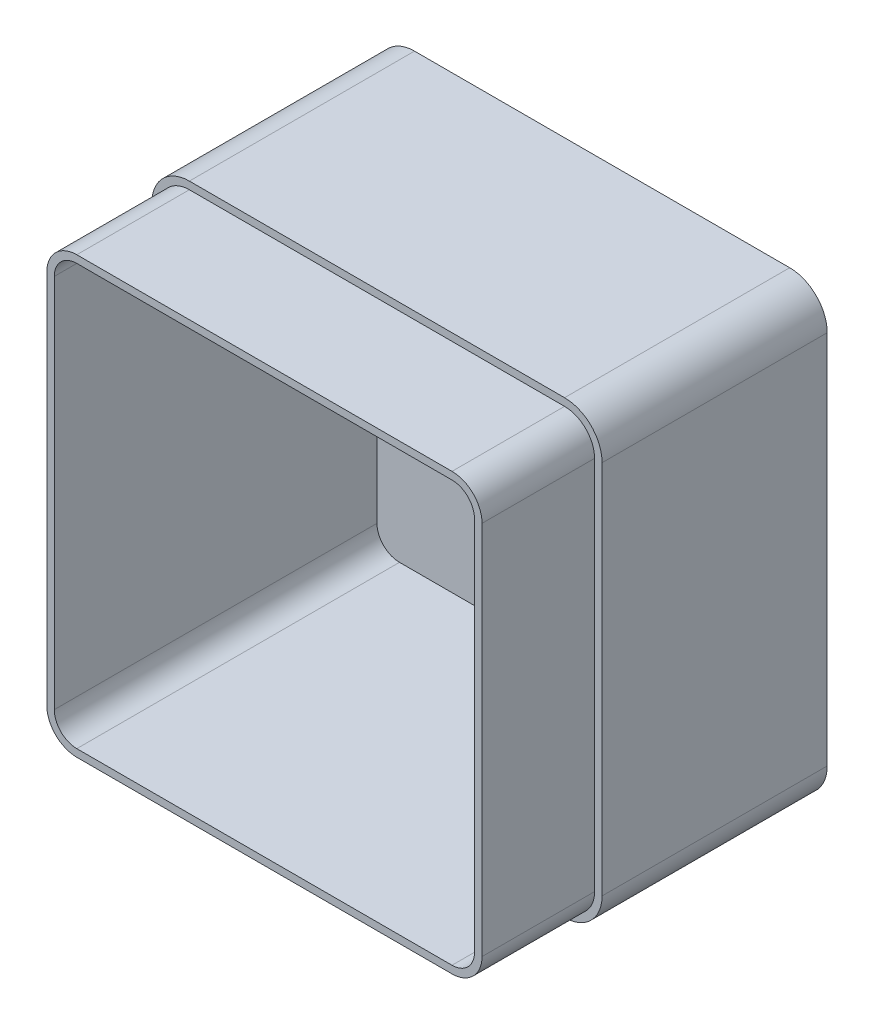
from build123d import *

# Parameters (mm, degrees)
SKETCH1_W          = 120
SKETCH1_H          = 120
BASE_EXTRUDE_DEPTH = 90
FILLET1_R          = 10
SHELL1_T           = -4
CUT_EXTRUDE1_DEPTH = 30


with BuildPart() as part:
    # Sketch1 → Base-Extrude (new body)
    with BuildSketch(Plane.XY):
        with Locations((60, 60)):
            Rectangle(SKETCH1_W, SKETCH1_H)
    extrude(amount=BASE_EXTRUDE_DEPTH)

    # Fillet1
    fillet1_edges = [part.edges().sort_by_distance(p)[0] for p in [
        (0, 120, 45),
        (120, 120, 45),
        (120, 0, 45),
        (0, 0, 45),
    ]]
    fillet(fillet1_edges, radius=FILLET1_R)

    # Shell1
    shell1_openings = [part.faces().sort_by_distance(p)[0] for p in [
        (60, 60, 90),
    ]]
    offset(amount=SHELL1_T, openings=shell1_openings, kind=Kind.INTERSECTION)

    # Sketch2 → Cut-Extrude1 (cut)
    with BuildSketch(Plane.XY.offset(90)):
        with BuildLine():
            Line((110, 120), (10, 120))
            ThreePointArc((10, 120), (2.928932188, 117.071067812), (0, 110))
            Line((0, 110), (0, 10))
            ThreePointArc((0, 10), (2.928932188, 2.928932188), (10, 0))
            Line((10, 0), (110, 0))
            ThreePointArc((110, 0), (117.071067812, 2.928932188), (120, 10))
            Line((120, 10), (120, 110))
            ThreePointArc((120, 110), (117.071067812, 117.071067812), (110, 120))
        make_face()
        with BuildLine():
            Line((118, 10), (118, 110))
            ThreePointArc((118, 110), (115.656854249, 115.656854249), (110, 118))
            Line((110, 118), (10, 118))
            ThreePointArc((10, 118), (4.343145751, 115.656854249), (2, 110))
            Line((2, 110), (2, 10))
            ThreePointArc((2, 10), (4.343145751, 4.343145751), (10, 2))
            Line((10, 2), (110, 2))
            ThreePointArc((110, 2), (115.656854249, 4.343145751), (118, 10))
        make_face(mode=Mode.SUBTRACT)
    extrude(amount=-CUT_EXTRUDE1_DEPTH, mode=Mode.SUBTRACT)


solid = part.part
